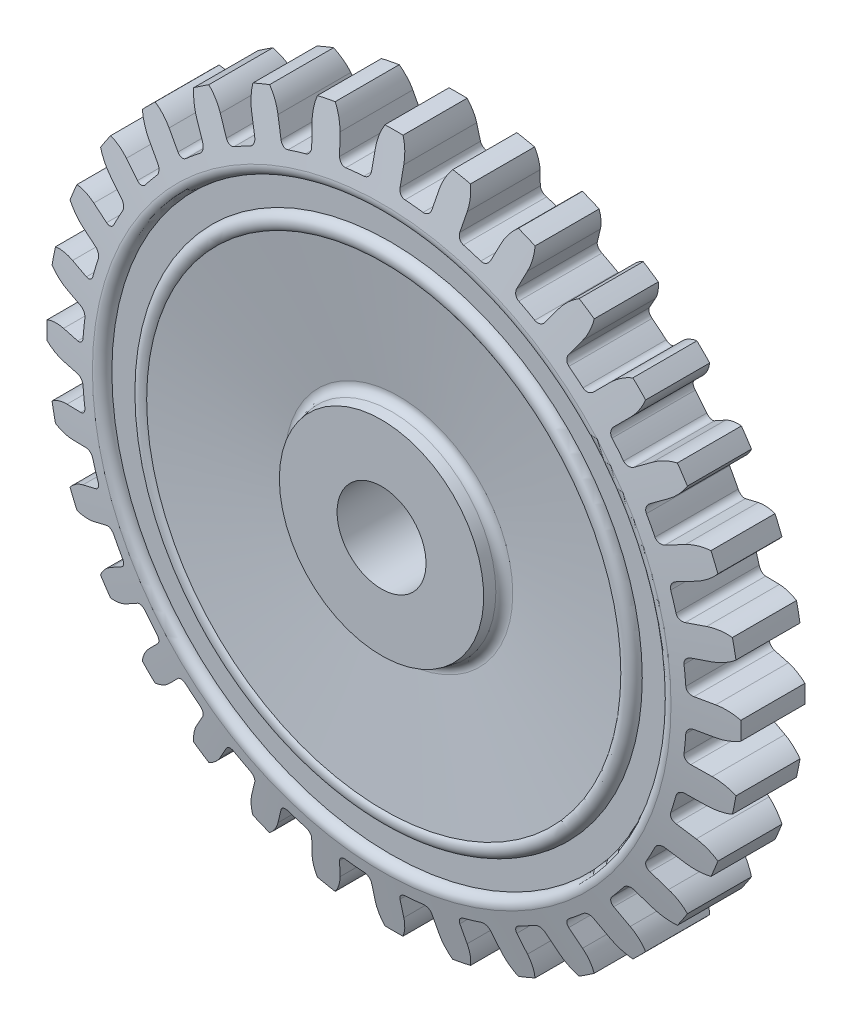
from build123d import *

# Parameters (mm, degrees)
SKETCH_6_OUTSIDE_W  = 102.152
SKETCH_6_OUTSIDE_H  = 102.152
CUT_EXTRUDE_3_DEPTH = 5


with BuildPart() as part:
    # Sketch 1 → Revolve 1 (revolve)
    with BuildSketch(Plane(origin=(0, 0, 0), x_dir=(1, 0, 0), z_dir=(0, 1, 0))):
        with BuildLine():
            Line((-39, -3.6), (-39, 3.6))
            Line((-39, 3.6), (-32.516325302, 4.978147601))
            ThreePointArc((-32.516325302, 4.978147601), (-31.67909322, 4.777145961), (-31.308413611, 4))
            Line((-31.308413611, 4), (-28.308413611, 4))
            ThreePointArc((-28.308413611, 4), (-27.719851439, 4.911437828), (-26.646975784, 4.75))
            Line((-26.646975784, 4.75), (-12.812738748, 3.061927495))
            ThreePointArc((-12.812738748, 3.061927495), (-12.104938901, 3.244743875), (-11.710660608, 3.860330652))
            Line((-11.710660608, 3.860330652), (-11.485, 5))
            Line((-11.485, 5), (-5, 5))
            Line((-5, 5), (-5, -5))
            Line((-5, -5), (-11.485, -5))
            Line((-11.485, -5), (-11.710660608, -3.860330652))
            ThreePointArc((-11.710660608, -3.860330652), (-12.104938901, -3.244743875), (-12.812738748, -3.061927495))
            Line((-12.812738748, -3.061927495), (-26.646975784, -4.75))
            ThreePointArc((-26.646975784, -4.75), (-27.719851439, -4.911437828), (-28.308413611, -4))
            Line((-28.308413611, -4), (-31.308413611, -4))
            ThreePointArc((-31.308413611, -4), (-31.67909322, -4.777145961), (-32.516325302, -4.978147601))
            Line((-32.516325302, -4.978147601), (-39, -3.6))
        make_face()
    revolve(axis=Axis((0, 0, -5), (0, 0, 1)))

    # Sketch 6 outside → Cut-Extrude 3 (cut, symmetric)
    with BuildSketch(Plane.XY):
        Rectangle(SKETCH_6_OUTSIDE_W, SKETCH_6_OUTSIDE_H)
        with BuildLine():
            Line((1.6, 36.642598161), (1.6, 34.630085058))
            ThreePointArc((1.6, 34.630085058), (1.804744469, 34.110979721), (2.308724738, 33.87140815))
            ThreePointArc((2.308724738, 33.87140815), (3.327681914, 33.786521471), (4.343620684, 33.670988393))
            ThreePointArc((4.343620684, 33.670988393), (4.884655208, 33.80763499), (5.186737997, 34.276822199))
            Line((5.186737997, 34.276822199), (5.579359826, 36.250665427))
            ThreePointArc((5.579359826, 36.250665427), (5.960237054, 37.406416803), (6.609028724, 38.435930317))
            ThreePointArc((6.609028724, 38.435930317), (7.608522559, 38.250625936), (8.602847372, 38.039335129))
            ThreePointArc((8.602847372, 38.039335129), (8.808274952, 36.839906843), (8.717872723, 35.626376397))
            Line((8.717872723, 35.626376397), (8.325250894, 33.652533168))
            ThreePointArc((8.325250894, 33.652533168), (8.424788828, 33.10345863), (8.872347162, 32.770168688))
            ThreePointArc((8.872347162, 32.770168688), (9.855164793, 32.488124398), (10.829043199, 32.176611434))
            ThreePointArc((10.829043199, 32.176611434), (11.386340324, 32.205081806), (11.774152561, 32.606320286))
            Line((11.774152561, 32.606320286), (12.544307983, 34.465639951))
            ThreePointArc((12.544307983, 34.465639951), (13.14334267, 35.524878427), (13.980516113, 36.408037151))
            ThreePointArc((13.980516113, 36.408037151), (14.924653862, 36.031301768), (15.858652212, 35.630087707))
            ThreePointArc((15.858652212, 35.630087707), (15.826135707, 34.413629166), (15.500722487, 33.241052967))
            Line((15.500722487, 33.241052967), (14.730567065, 31.381733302))
            ThreePointArc((14.730567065, 31.381733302), (14.721073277, 30.82379019), (15.095010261, 30.40959002))
            ThreePointArc((15.095010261, 30.40959002), (16.003919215, 29.941226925), (16.898311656, 29.445705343))
            ThreePointArc((16.898311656, 29.445705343), (17.450454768, 29.364905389), (17.909093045, 29.68277577))
            Line((17.909093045, 29.68277577), (19.027185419, 31.35611926))
            ThreePointArc((19.027185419, 31.35611926), (19.821356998, 32.278138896), (20.814740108, 32.981003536))
            ThreePointArc((20.814740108, 32.981003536), (21.667239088, 32.42731488), (22.505017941, 31.851595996))
            ThreePointArc((22.505017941, 31.851595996), (22.235806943, 30.66485502), (21.687888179, 29.578294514))
            Line((21.687888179, 29.578294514), (20.569795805, 27.904951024))
            ThreePointArc((20.569795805, 27.904951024), (20.451635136, 27.359580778), (20.737580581, 26.880387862))
            ThreePointArc((20.737580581, 26.880387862), (21.537651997, 26.243704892), (22.318187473, 25.583217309))
            ThreePointArc((22.318187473, 25.583217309), (22.843958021, 25.396252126), (23.355797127, 25.618538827))
            Line((23.355797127, 25.618538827), (24.77885879, 27.04160049))
            ThreePointArc((24.77885879, 27.04160049), (25.737647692, 27.790968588), (26.849065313, 28.286528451))
            ThreePointArc((26.849065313, 28.286528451), (27.577164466, 27.577164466), (28.286528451, 26.849065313))
            ThreePointArc((28.286528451, 26.849065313), (27.790968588, 25.737647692), (27.04160049, 24.77885879))
            Line((27.04160049, 24.77885879), (25.618538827, 23.355797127))
            ThreePointArc((25.618538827, 23.355797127), (25.396252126, 22.843958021), (25.583217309, 22.318187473))
            ThreePointArc((25.583217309, 22.318187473), (26.243704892, 21.537651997), (26.880387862, 20.737580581))
            ThreePointArc((26.880387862, 20.737580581), (27.359580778, 20.451635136), (27.904951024, 20.569795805))
            Line((27.904951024, 20.569795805), (29.578294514, 21.687888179))
            ThreePointArc((29.578294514, 21.687888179), (30.66485502, 22.235806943), (31.851595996, 22.505017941))
            ThreePointArc((31.851595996, 22.505017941), (32.42731488, 21.667239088), (32.981003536, 20.814740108))
            ThreePointArc((32.981003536, 20.814740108), (32.278138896, 19.821356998), (31.35611926, 19.027185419))
            Line((31.35611926, 19.027185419), (29.68277577, 17.909093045))
            ThreePointArc((29.68277577, 17.909093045), (29.364905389, 17.450454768), (29.445705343, 16.898311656))
            ThreePointArc((29.445705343, 16.898311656), (29.941226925, 16.003919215), (30.40959002, 15.095010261))
            ThreePointArc((30.40959002, 15.095010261), (30.82379019, 14.721073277), (31.381733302, 14.730567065))
            Line((31.381733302, 14.730567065), (33.241052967, 15.500722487))
            ThreePointArc((33.241052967, 15.500722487), (34.413629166, 15.826135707), (35.630087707, 15.858652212))
            ThreePointArc((35.630087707, 15.858652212), (36.031301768, 14.924653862), (36.408037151, 13.980516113))
            ThreePointArc((36.408037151, 13.980516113), (35.524878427, 13.14334267), (34.465639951, 12.544307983))
            Line((34.465639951, 12.544307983), (32.606320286, 11.774152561))
            ThreePointArc((32.606320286, 11.774152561), (32.205081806, 11.386340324), (32.176611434, 10.829043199))
            ThreePointArc((32.176611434, 10.829043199), (32.488124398, 9.855164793), (32.770168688, 8.872347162))
            ThreePointArc((32.770168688, 8.872347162), (33.10345863, 8.424788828), (33.652533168, 8.325250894))
            Line((33.652533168, 8.325250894), (35.626376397, 8.717872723))
            ThreePointArc((35.626376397, 8.717872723), (36.839906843, 8.808274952), (38.039335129, 8.602847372))
            ThreePointArc((38.039335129, 8.602847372), (38.250625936, 7.608522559), (38.435930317, 6.609028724))
            ThreePointArc((38.435930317, 6.609028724), (37.406416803, 5.960237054), (36.250665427, 5.579359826))
            Line((36.250665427, 5.579359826), (34.276822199, 5.186737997))
            ThreePointArc((34.276822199, 5.186737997), (33.80763499, 4.884655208), (33.670988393, 4.343620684))
            ThreePointArc((33.670988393, 4.343620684), (33.786521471, 3.327681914), (33.87140815, 2.308724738))
            ThreePointArc((33.87140815, 2.308724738), (34.110979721, 1.804744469), (34.630085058, 1.6))
            Line((34.630085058, 1.6), (36.642598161, 1.6))
            ThreePointArc((36.642598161, 1.6), (37.850447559, 1.451917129), (38.986752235, 1.016439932))
            ThreePointArc((38.986752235, 1.016439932), (39, 0), (38.986752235, -1.016439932))
            ThreePointArc((38.986752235, -1.016439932), (37.850447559, -1.451917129), (36.642598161, -1.6))
            Line((36.642598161, -1.6), (34.630085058, -1.6))
            ThreePointArc((34.630085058, -1.6), (34.110979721, -1.804744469), (33.87140815, -2.308724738))
            ThreePointArc((33.87140815, -2.308724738), (33.786521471, -3.327681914), (33.670988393, -4.343620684))
            ThreePointArc((33.670988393, -4.343620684), (33.80763499, -4.884655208), (34.276822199, -5.186737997))
            Line((34.276822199, -5.186737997), (36.250665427, -5.579359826))
            ThreePointArc((36.250665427, -5.579359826), (37.406416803, -5.960237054), (38.435930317, -6.609028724))
            ThreePointArc((38.435930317, -6.609028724), (38.250625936, -7.608522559), (38.039335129, -8.602847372))
            ThreePointArc((38.039335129, -8.602847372), (36.839906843, -8.808274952), (35.626376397, -8.717872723))
            Line((35.626376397, -8.717872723), (33.652533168, -8.325250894))
            ThreePointArc((33.652533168, -8.325250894), (33.10345863, -8.424788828), (32.770168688, -8.872347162))
            ThreePointArc((32.770168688, -8.872347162), (32.488124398, -9.855164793), (32.176611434, -10.829043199))
            ThreePointArc((32.176611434, -10.829043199), (32.205081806, -11.386340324), (32.606320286, -11.774152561))
            Line((32.606320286, -11.774152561), (34.465639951, -12.544307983))
            ThreePointArc((34.465639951, -12.544307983), (35.524878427, -13.14334267), (36.408037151, -13.980516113))
            ThreePointArc((36.408037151, -13.980516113), (36.031301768, -14.924653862), (35.630087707, -15.858652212))
            ThreePointArc((35.630087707, -15.858652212), (34.413629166, -15.826135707), (33.241052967, -15.500722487))
            Line((33.241052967, -15.500722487), (31.381733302, -14.730567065))
            ThreePointArc((31.381733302, -14.730567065), (30.82379019, -14.721073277), (30.40959002, -15.095010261))
            ThreePointArc((30.40959002, -15.095010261), (29.941226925, -16.003919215), (29.445705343, -16.898311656))
            ThreePointArc((29.445705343, -16.898311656), (29.364905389, -17.450454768), (29.68277577, -17.909093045))
            Line((29.68277577, -17.909093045), (31.35611926, -19.027185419))
            ThreePointArc((31.35611926, -19.027185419), (32.278138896, -19.821356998), (32.981003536, -20.814740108))
            ThreePointArc((32.981003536, -20.814740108), (32.42731488, -21.667239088), (31.851595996, -22.505017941))
            ThreePointArc((31.851595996, -22.505017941), (30.66485502, -22.235806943), (29.578294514, -21.687888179))
            Line((29.578294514, -21.687888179), (27.904951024, -20.569795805))
            ThreePointArc((27.904951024, -20.569795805), (27.359580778, -20.451635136), (26.880387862, -20.737580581))
            ThreePointArc((26.880387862, -20.737580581), (26.243704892, -21.537651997), (25.583217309, -22.318187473))
            ThreePointArc((25.583217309, -22.318187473), (25.396252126, -22.843958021), (25.618538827, -23.355797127))
            Line((25.618538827, -23.355797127), (27.04160049, -24.77885879))
            ThreePointArc((27.04160049, -24.77885879), (27.790968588, -25.737647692), (28.286528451, -26.849065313))
            ThreePointArc((28.286528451, -26.849065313), (27.577164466, -27.577164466), (26.849065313, -28.286528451))
            ThreePointArc((26.849065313, -28.286528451), (25.737647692, -27.790968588), (24.77885879, -27.04160049))
            Line((24.77885879, -27.04160049), (23.355797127, -25.618538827))
            ThreePointArc((23.355797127, -25.618538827), (22.843958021, -25.396252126), (22.318187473, -25.583217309))
            ThreePointArc((22.318187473, -25.583217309), (21.537651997, -26.243704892), (20.737580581, -26.880387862))
            ThreePointArc((20.737580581, -26.880387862), (20.451635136, -27.359580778), (20.569795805, -27.904951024))
            Line((20.569795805, -27.904951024), (21.687888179, -29.578294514))
            ThreePointArc((21.687888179, -29.578294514), (22.235806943, -30.66485502), (22.505017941, -31.851595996))
            ThreePointArc((22.505017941, -31.851595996), (21.667239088, -32.42731488), (20.814740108, -32.981003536))
            ThreePointArc((20.814740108, -32.981003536), (19.821356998, -32.278138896), (19.027185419, -31.35611926))
            Line((19.027185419, -31.35611926), (17.909093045, -29.68277577))
            ThreePointArc((17.909093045, -29.68277577), (17.450454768, -29.364905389), (16.898311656, -29.445705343))
            ThreePointArc((16.898311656, -29.445705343), (16.003919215, -29.941226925), (15.095010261, -30.40959002))
            ThreePointArc((15.095010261, -30.40959002), (14.721073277, -30.82379019), (14.730567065, -31.381733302))
            Line((14.730567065, -31.381733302), (15.500722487, -33.241052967))
            ThreePointArc((15.500722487, -33.241052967), (15.826135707, -34.413629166), (15.858652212, -35.630087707))
            ThreePointArc((15.858652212, -35.630087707), (14.924653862, -36.031301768), (13.980516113, -36.408037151))
            ThreePointArc((13.980516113, -36.408037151), (13.14334267, -35.524878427), (12.544307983, -34.465639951))
            Line((12.544307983, -34.465639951), (11.774152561, -32.606320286))
            ThreePointArc((11.774152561, -32.606320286), (11.386340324, -32.205081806), (10.829043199, -32.176611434))
            ThreePointArc((10.829043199, -32.176611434), (9.855164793, -32.488124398), (8.872347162, -32.770168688))
            ThreePointArc((8.872347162, -32.770168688), (8.424788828, -33.10345863), (8.325250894, -33.652533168))
            Line((8.325250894, -33.652533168), (8.717872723, -35.626376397))
            ThreePointArc((8.717872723, -35.626376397), (8.808274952, -36.839906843), (8.602847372, -38.039335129))
            ThreePointArc((8.602847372, -38.039335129), (7.608522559, -38.250625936), (6.609028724, -38.435930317))
            ThreePointArc((6.609028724, -38.435930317), (5.960237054, -37.406416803), (5.579359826, -36.250665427))
            Line((5.579359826, -36.250665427), (5.186737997, -34.276822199))
            ThreePointArc((5.186737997, -34.276822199), (4.884655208, -33.80763499), (4.343620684, -33.670988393))
            ThreePointArc((4.343620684, -33.670988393), (3.327681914, -33.786521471), (2.308724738, -33.87140815))
            ThreePointArc((2.308724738, -33.87140815), (1.804744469, -34.110979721), (1.6, -34.630085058))
            Line((1.6, -34.630085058), (1.6, -36.642598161))
            ThreePointArc((1.6, -36.642598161), (1.451917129, -37.850447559), (1.016439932, -38.986752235))
            ThreePointArc((1.016439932, -38.986752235), (0, -39), (-1.016439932, -38.986752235))
            ThreePointArc((-1.016439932, -38.986752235), (-1.451917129, -37.850447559), (-1.6, -36.642598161))
            Line((-1.6, -36.642598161), (-1.6, -34.630085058))
            ThreePointArc((-1.6, -34.630085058), (-1.804744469, -34.110979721), (-2.308724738, -33.87140815))
            ThreePointArc((-2.308724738, -33.87140815), (-3.327681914, -33.786521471), (-4.343620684, -33.670988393))
            ThreePointArc((-4.343620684, -33.670988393), (-4.884655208, -33.80763499), (-5.186737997, -34.276822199))
            Line((-5.186737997, -34.276822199), (-5.579359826, -36.250665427))
            ThreePointArc((-5.579359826, -36.250665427), (-5.960237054, -37.406416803), (-6.609028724, -38.435930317))
            ThreePointArc((-6.609028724, -38.435930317), (-7.608522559, -38.250625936), (-8.602847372, -38.039335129))
            ThreePointArc((-8.602847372, -38.039335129), (-8.808274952, -36.839906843), (-8.717872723, -35.626376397))
            Line((-8.717872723, -35.626376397), (-8.325250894, -33.652533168))
            ThreePointArc((-8.325250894, -33.652533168), (-8.424788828, -33.10345863), (-8.872347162, -32.770168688))
            ThreePointArc((-8.872347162, -32.770168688), (-9.855164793, -32.488124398), (-10.829043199, -32.176611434))
            ThreePointArc((-10.829043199, -32.176611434), (-11.386340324, -32.205081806), (-11.774152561, -32.606320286))
            Line((-11.774152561, -32.606320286), (-12.544307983, -34.465639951))
            ThreePointArc((-12.544307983, -34.465639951), (-13.14334267, -35.524878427), (-13.980516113, -36.408037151))
            ThreePointArc((-13.980516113, -36.408037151), (-14.924653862, -36.031301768), (-15.858652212, -35.630087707))
            ThreePointArc((-15.858652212, -35.630087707), (-15.826135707, -34.413629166), (-15.500722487, -33.241052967))
            Line((-15.500722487, -33.241052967), (-14.730567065, -31.381733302))
            ThreePointArc((-14.730567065, -31.381733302), (-14.721073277, -30.82379019), (-15.095010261, -30.40959002))
            ThreePointArc((-15.095010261, -30.40959002), (-16.003919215, -29.941226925), (-16.898311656, -29.445705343))
            ThreePointArc((-16.898311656, -29.445705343), (-17.450454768, -29.364905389), (-17.909093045, -29.68277577))
            Line((-17.909093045, -29.68277577), (-19.027185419, -31.35611926))
            ThreePointArc((-19.027185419, -31.35611926), (-19.821356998, -32.278138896), (-20.814740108, -32.981003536))
            ThreePointArc((-20.814740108, -32.981003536), (-21.667239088, -32.42731488), (-22.505017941, -31.851595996))
            ThreePointArc((-22.505017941, -31.851595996), (-22.235806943, -30.66485502), (-21.687888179, -29.578294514))
            Line((-21.687888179, -29.578294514), (-20.569795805, -27.904951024))
            ThreePointArc((-20.569795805, -27.904951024), (-20.451635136, -27.359580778), (-20.737580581, -26.880387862))
            ThreePointArc((-20.737580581, -26.880387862), (-21.537651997, -26.243704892), (-22.318187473, -25.583217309))
            ThreePointArc((-22.318187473, -25.583217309), (-22.843958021, -25.396252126), (-23.355797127, -25.618538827))
            Line((-23.355797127, -25.618538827), (-24.77885879, -27.04160049))
            ThreePointArc((-24.77885879, -27.04160049), (-25.737647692, -27.790968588), (-26.849065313, -28.286528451))
            ThreePointArc((-26.849065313, -28.286528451), (-27.577164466, -27.577164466), (-28.286528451, -26.849065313))
            ThreePointArc((-28.286528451, -26.849065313), (-27.790968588, -25.737647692), (-27.04160049, -24.77885879))
            Line((-27.04160049, -24.77885879), (-25.618538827, -23.355797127))
            ThreePointArc((-25.618538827, -23.355797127), (-25.396252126, -22.843958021), (-25.583217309, -22.318187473))
            ThreePointArc((-25.583217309, -22.318187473), (-26.243704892, -21.537651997), (-26.880387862, -20.737580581))
            ThreePointArc((-26.880387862, -20.737580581), (-27.359580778, -20.451635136), (-27.904951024, -20.569795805))
            Line((-27.904951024, -20.569795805), (-29.578294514, -21.687888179))
            ThreePointArc((-29.578294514, -21.687888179), (-30.66485502, -22.235806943), (-31.851595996, -22.505017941))
            ThreePointArc((-31.851595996, -22.505017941), (-32.42731488, -21.667239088), (-32.981003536, -20.814740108))
            ThreePointArc((-32.981003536, -20.814740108), (-32.278138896, -19.821356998), (-31.35611926, -19.027185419))
            Line((-31.35611926, -19.027185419), (-29.68277577, -17.909093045))
            ThreePointArc((-29.68277577, -17.909093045), (-29.364905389, -17.450454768), (-29.445705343, -16.898311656))
            ThreePointArc((-29.445705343, -16.898311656), (-29.941226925, -16.003919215), (-30.40959002, -15.095010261))
            ThreePointArc((-30.40959002, -15.095010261), (-30.82379019, -14.721073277), (-31.381733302, -14.730567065))
            Line((-31.381733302, -14.730567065), (-33.241052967, -15.500722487))
            ThreePointArc((-33.241052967, -15.500722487), (-34.413629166, -15.826135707), (-35.630087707, -15.858652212))
            ThreePointArc((-35.630087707, -15.858652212), (-36.031301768, -14.924653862), (-36.408037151, -13.980516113))
            ThreePointArc((-36.408037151, -13.980516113), (-35.524878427, -13.14334267), (-34.465639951, -12.544307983))
            Line((-34.465639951, -12.544307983), (-32.606320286, -11.774152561))
            ThreePointArc((-32.606320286, -11.774152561), (-32.205081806, -11.386340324), (-32.176611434, -10.829043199))
            ThreePointArc((-32.176611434, -10.829043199), (-32.488124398, -9.855164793), (-32.770168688, -8.872347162))
            ThreePointArc((-32.770168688, -8.872347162), (-33.10345863, -8.424788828), (-33.652533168, -8.325250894))
            Line((-33.652533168, -8.325250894), (-35.626376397, -8.717872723))
            ThreePointArc((-35.626376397, -8.717872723), (-36.839906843, -8.808274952), (-38.039335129, -8.602847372))
            ThreePointArc((-38.039335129, -8.602847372), (-38.250625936, -7.608522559), (-38.435930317, -6.609028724))
            ThreePointArc((-38.435930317, -6.609028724), (-37.406416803, -5.960237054), (-36.250665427, -5.579359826))
            Line((-36.250665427, -5.579359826), (-34.276822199, -5.186737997))
            ThreePointArc((-34.276822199, -5.186737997), (-33.80763499, -4.884655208), (-33.670988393, -4.343620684))
            ThreePointArc((-33.670988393, -4.343620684), (-33.786521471, -3.327681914), (-33.87140815, -2.308724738))
            ThreePointArc((-33.87140815, -2.308724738), (-34.110979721, -1.804744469), (-34.630085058, -1.6))
            Line((-34.630085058, -1.6), (-36.642598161, -1.6))
            ThreePointArc((-36.642598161, -1.6), (-37.850447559, -1.451917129), (-38.986752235, -1.016439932))
            ThreePointArc((-38.986752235, -1.016439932), (-39, 0), (-38.986752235, 1.016439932))
            ThreePointArc((-38.986752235, 1.016439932), (-37.850447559, 1.451917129), (-36.642598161, 1.6))
            Line((-36.642598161, 1.6), (-34.630085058, 1.6))
            ThreePointArc((-34.630085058, 1.6), (-34.110979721, 1.804744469), (-33.87140815, 2.308724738))
            ThreePointArc((-33.87140815, 2.308724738), (-33.786521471, 3.327681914), (-33.670988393, 4.343620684))
            ThreePointArc((-33.670988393, 4.343620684), (-33.80763499, 4.884655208), (-34.276822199, 5.186737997))
            Line((-34.276822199, 5.186737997), (-36.250665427, 5.579359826))
            ThreePointArc((-36.250665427, 5.579359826), (-37.406416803, 5.960237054), (-38.435930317, 6.609028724))
            ThreePointArc((-38.435930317, 6.609028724), (-38.250625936, 7.608522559), (-38.039335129, 8.602847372))
            ThreePointArc((-38.039335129, 8.602847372), (-36.839906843, 8.808274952), (-35.626376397, 8.717872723))
            Line((-35.626376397, 8.717872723), (-33.652533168, 8.325250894))
            ThreePointArc((-33.652533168, 8.325250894), (-33.10345863, 8.424788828), (-32.770168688, 8.872347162))
            ThreePointArc((-32.770168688, 8.872347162), (-32.488124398, 9.855164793), (-32.176611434, 10.829043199))
            ThreePointArc((-32.176611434, 10.829043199), (-32.205081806, 11.386340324), (-32.606320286, 11.774152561))
            Line((-32.606320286, 11.774152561), (-34.465639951, 12.544307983))
            ThreePointArc((-34.465639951, 12.544307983), (-35.524878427, 13.14334267), (-36.408037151, 13.980516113))
            ThreePointArc((-36.408037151, 13.980516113), (-36.031301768, 14.924653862), (-35.630087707, 15.858652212))
            ThreePointArc((-35.630087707, 15.858652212), (-34.413629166, 15.826135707), (-33.241052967, 15.500722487))
            Line((-33.241052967, 15.500722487), (-31.381733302, 14.730567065))
            ThreePointArc((-31.381733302, 14.730567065), (-30.82379019, 14.721073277), (-30.40959002, 15.095010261))
            ThreePointArc((-30.40959002, 15.095010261), (-29.941226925, 16.003919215), (-29.445705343, 16.898311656))
            ThreePointArc((-29.445705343, 16.898311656), (-29.364905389, 17.450454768), (-29.68277577, 17.909093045))
            Line((-29.68277577, 17.909093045), (-31.35611926, 19.027185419))
            ThreePointArc((-31.35611926, 19.027185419), (-32.278138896, 19.821356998), (-32.981003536, 20.814740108))
            ThreePointArc((-32.981003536, 20.814740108), (-32.42731488, 21.667239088), (-31.851595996, 22.505017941))
            ThreePointArc((-31.851595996, 22.505017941), (-30.66485502, 22.235806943), (-29.578294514, 21.687888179))
            Line((-29.578294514, 21.687888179), (-27.904951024, 20.569795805))
            ThreePointArc((-27.904951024, 20.569795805), (-27.359580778, 20.451635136), (-26.880387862, 20.737580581))
            ThreePointArc((-26.880387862, 20.737580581), (-26.243704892, 21.537651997), (-25.583217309, 22.318187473))
            ThreePointArc((-25.583217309, 22.318187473), (-25.396252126, 22.843958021), (-25.618538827, 23.355797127))
            Line((-25.618538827, 23.355797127), (-27.04160049, 24.77885879))
            ThreePointArc((-27.04160049, 24.77885879), (-27.790968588, 25.737647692), (-28.286528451, 26.849065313))
            ThreePointArc((-28.286528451, 26.849065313), (-27.577164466, 27.577164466), (-26.849065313, 28.286528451))
            ThreePointArc((-26.849065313, 28.286528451), (-25.737647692, 27.790968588), (-24.77885879, 27.04160049))
            Line((-24.77885879, 27.04160049), (-23.355797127, 25.618538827))
            ThreePointArc((-23.355797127, 25.618538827), (-22.843958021, 25.396252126), (-22.318187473, 25.583217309))
            ThreePointArc((-22.318187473, 25.583217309), (-21.537651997, 26.243704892), (-20.737580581, 26.880387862))
            ThreePointArc((-20.737580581, 26.880387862), (-20.451635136, 27.359580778), (-20.569795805, 27.904951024))
            Line((-20.569795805, 27.904951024), (-21.687888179, 29.578294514))
            ThreePointArc((-21.687888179, 29.578294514), (-22.235806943, 30.66485502), (-22.505017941, 31.851595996))
            ThreePointArc((-22.505017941, 31.851595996), (-21.667239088, 32.42731488), (-20.814740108, 32.981003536))
            ThreePointArc((-20.814740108, 32.981003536), (-19.821356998, 32.278138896), (-19.027185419, 31.35611926))
            Line((-19.027185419, 31.35611926), (-17.909093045, 29.68277577))
            ThreePointArc((-17.909093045, 29.68277577), (-17.450454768, 29.364905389), (-16.898311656, 29.445705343))
            ThreePointArc((-16.898311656, 29.445705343), (-16.003919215, 29.941226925), (-15.095010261, 30.40959002))
            ThreePointArc((-15.095010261, 30.40959002), (-14.721073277, 30.82379019), (-14.730567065, 31.381733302))
            Line((-14.730567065, 31.381733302), (-15.500722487, 33.241052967))
            ThreePointArc((-15.500722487, 33.241052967), (-15.826135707, 34.413629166), (-15.858652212, 35.630087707))
            ThreePointArc((-15.858652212, 35.630087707), (-14.924653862, 36.031301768), (-13.980516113, 36.408037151))
            ThreePointArc((-13.980516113, 36.408037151), (-13.14334267, 35.524878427), (-12.544307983, 34.465639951))
            Line((-12.544307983, 34.465639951), (-11.774152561, 32.606320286))
            ThreePointArc((-11.774152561, 32.606320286), (-11.386340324, 32.205081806), (-10.829043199, 32.176611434))
            ThreePointArc((-10.829043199, 32.176611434), (-9.855164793, 32.488124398), (-8.872347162, 32.770168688))
            ThreePointArc((-8.872347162, 32.770168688), (-8.424788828, 33.10345863), (-8.325250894, 33.652533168))
            Line((-8.325250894, 33.652533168), (-8.717872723, 35.626376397))
            ThreePointArc((-8.717872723, 35.626376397), (-8.808274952, 36.839906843), (-8.602847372, 38.039335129))
            ThreePointArc((-8.602847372, 38.039335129), (-7.608522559, 38.250625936), (-6.609028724, 38.435930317))
            ThreePointArc((-6.609028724, 38.435930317), (-5.960237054, 37.406416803), (-5.579359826, 36.250665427))
            Line((-5.579359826, 36.250665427), (-5.186737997, 34.276822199))
            ThreePointArc((-5.186737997, 34.276822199), (-4.884655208, 33.80763499), (-4.343620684, 33.670988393))
            ThreePointArc((-4.343620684, 33.670988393), (-3.327681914, 33.786521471), (-2.308724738, 33.87140815))
            ThreePointArc((-2.308724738, 33.87140815), (-1.804744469, 34.110979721), (-1.6, 34.630085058))
            Line((-1.6, 34.630085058), (-1.6, 36.642598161))
            ThreePointArc((-1.6, 36.642598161), (-1.451917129, 37.850447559), (-1.016439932, 38.986752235))
            ThreePointArc((-1.016439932, 38.986752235), (0, 39), (1.016439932, 38.986752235))
            ThreePointArc((1.016439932, 38.986752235), (1.451917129, 37.850447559), (1.6, 36.642598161))
        make_face(mode=Mode.SUBTRACT)
    extrude(amount=CUT_EXTRUDE_3_DEPTH, both=True, mode=Mode.SUBTRACT)


solid = part.part
